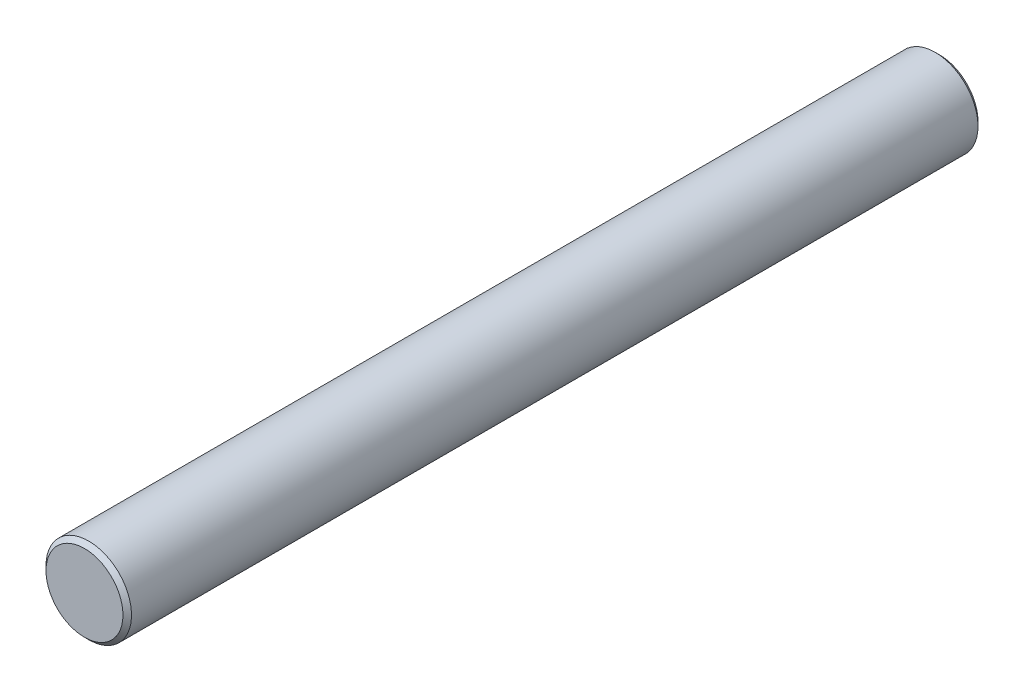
from build123d import *

# Parameters (mm, degrees)
ESQUISSE1_R      = 5
EXTRUSION1_DEPTH = 100
CHANFREIN1_SIZE  = 0.5


with BuildPart() as part:
    # Esquisse1 → Extrusion1 (new body)
    with BuildSketch(Plane.XY):
        with Locations(Location((0, 0, 0), (0, 0, 180))):
            Circle(ESQUISSE1_R)
    extrude(amount=EXTRUSION1_DEPTH)

    # Chanfrein1
    chanfrein1_edges = [part.edges().sort_by_distance(p)[0] for p in [
        (5, 0, 0),
        (5, 0, 100),
    ]]
    chamfer(chanfrein1_edges, length=CHANFREIN1_SIZE)


solid = part.part
